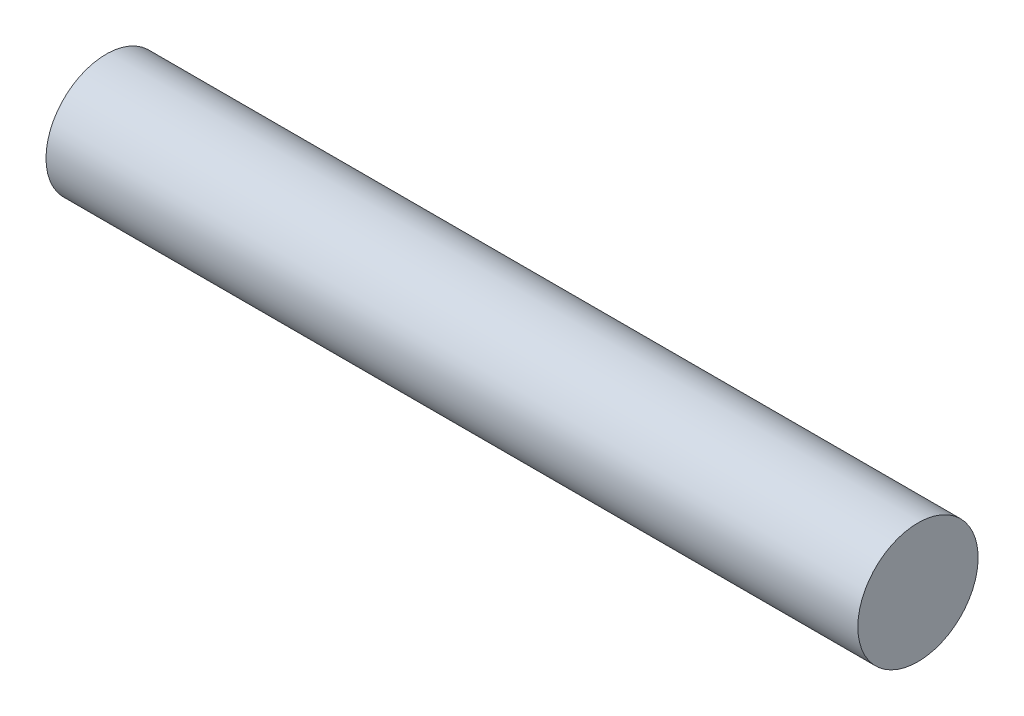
ISO-10303-21;
HEADER;
FILE_DESCRIPTION(('STEP AP214'),'2;1');
FILE_NAME('part.step','',(''),(''),'','','');
FILE_SCHEMA(('AUTOMOTIVE_DESIGN { 1 0 10303 214 1 1 1 1 }'));
ENDSEC;
DATA;
#1=APPLICATION_CONTEXT('core data for automotive mechanical design processes');
#2=APPLICATION_PROTOCOL_DEFINITION('international standard','automotive_design',2000,#1);
#3=PRODUCT_CONTEXT('',#1,'mechanical');
#4=PRODUCT('Part','Part','',(#3));
#5=PRODUCT_RELATED_PRODUCT_CATEGORY('part','',(#4));
#6=PRODUCT_DEFINITION_FORMATION('','',#4);
#7=PRODUCT_DEFINITION_CONTEXT('part definition',#1,'design');
#8=PRODUCT_DEFINITION('design','',#6,#7);
#9=PRODUCT_DEFINITION_SHAPE('','',#8);
#10=(LENGTH_UNIT() NAMED_UNIT(*) SI_UNIT(.MILLI.,.METRE.));
#11=(NAMED_UNIT(*) PLANE_ANGLE_UNIT() SI_UNIT($,.RADIAN.));
#12=(NAMED_UNIT(*) SI_UNIT($,.STERADIAN.) SOLID_ANGLE_UNIT());
#13=UNCERTAINTY_MEASURE_WITH_UNIT(LENGTH_MEASURE(1.E-05),#10,'distance_accuracy_value','');
#14=(GEOMETRIC_REPRESENTATION_CONTEXT(3) GLOBAL_UNCERTAINTY_ASSIGNED_CONTEXT((#13)) GLOBAL_UNIT_ASSIGNED_CONTEXT((#10,
#11,#12)) REPRESENTATION_CONTEXT('',''));
#15=CARTESIAN_POINT('',(0.,0.,0.));
#16=DIRECTION('',(0.,0.,1.));
#17=DIRECTION('',(1.,0.,0.));
#18=AXIS2_PLACEMENT_3D('',#15,#16,#17);
#19=CARTESIAN_POINT('',(0.,0.,0.));
#20=DIRECTION('',(1.,0.,0.));
#21=DIRECTION('',(0.,0.,-1.));
#22=AXIS2_PLACEMENT_3D('',#19,#20,#21);
#23=PLANE('',#22);
#24=CARTESIAN_POINT('',(0.,0.,0.));
#25=DIRECTION('',(-1.,0.,0.));
#26=DIRECTION('',(0.,0.,1.));
#27=AXIS2_PLACEMENT_3D('',#24,#25,#26);
#28=CIRCLE('',#27,2.000000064);
#29=CARTESIAN_POINT('',(0.,0.,2.000000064));
#30=VERTEX_POINT('',#29);
#31=EDGE_CURVE('E10',#30,#30,#28,.T.);
#32=ORIENTED_EDGE('',*,*,#31,.T.);
#33=EDGE_LOOP('',(#32));
#34=FACE_BOUND('',#33,.T.);
#35=ADVANCED_FACE('F31',(#34),#23,.F.);
#36=CARTESIAN_POINT('',(27.,0.,0.));
#37=DIRECTION('',(-1.,0.,0.));
#38=DIRECTION('',(0.,0.,1.));
#39=AXIS2_PLACEMENT_3D('',#36,#37,#38);
#40=CYLINDRICAL_SURFACE('',#39,2.000000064);
#41=ORIENTED_EDGE('',*,*,#31,.F.);
#42=EDGE_LOOP('',(#41));
#43=FACE_BOUND('',#42,.T.);
#44=CARTESIAN_POINT('',(27.,0.,0.));
#45=DIRECTION('',(-1.,0.,0.));
#46=DIRECTION('',(0.,0.,1.));
#47=AXIS2_PLACEMENT_3D('',#44,#45,#46);
#48=CIRCLE('',#47,2.000000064);
#49=CARTESIAN_POINT('',(27.,0.,2.000000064));
#50=VERTEX_POINT('',#49);
#51=EDGE_CURVE('E37',#50,#50,#48,.T.);
#52=ORIENTED_EDGE('',*,*,#51,.T.);
#53=EDGE_LOOP('',(#52));
#54=FACE_BOUND('',#53,.T.);
#55=ADVANCED_FACE('F43',(#43,#54),#40,.T.);
#56=CARTESIAN_POINT('',(27.,2.000000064,0.));
#57=DIRECTION('',(-1.,0.,0.));
#58=DIRECTION('',(0.,0.,1.));
#59=AXIS2_PLACEMENT_3D('',#56,#57,#58);
#60=PLANE('',#59);
#61=ORIENTED_EDGE('',*,*,#51,.F.);
#62=EDGE_LOOP('',(#61));
#63=FACE_BOUND('',#62,.T.);
#64=ADVANCED_FACE('F45',(#63),#60,.F.);
#65=CLOSED_SHELL('',(#35,#55,#64));
#66=MANIFOLD_SOLID_BREP('B2',#65);
#67=ADVANCED_BREP_SHAPE_REPRESENTATION('',(#18,#66),#14);
#68=SHAPE_DEFINITION_REPRESENTATION(#9,#67);
ENDSEC;
END-ISO-10303-21;
